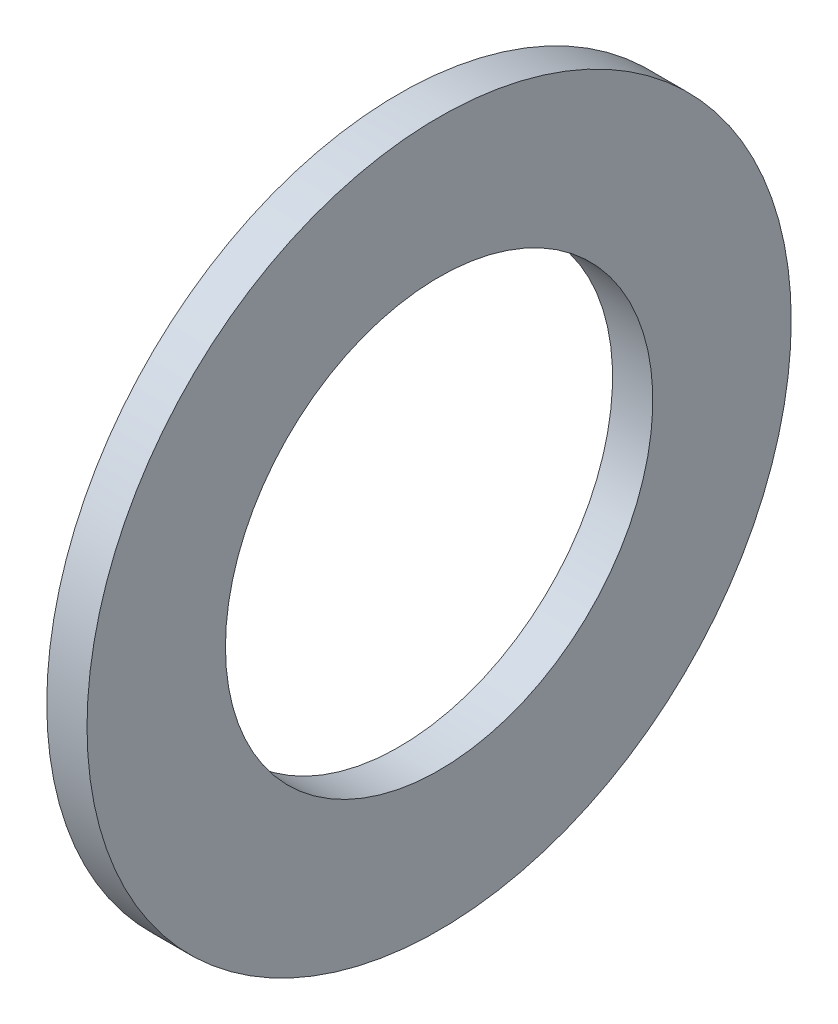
from build123d import *

# Parameters (mm, degrees)
SKETCH1_W = 2.54
SKETCH1_H = 8.7376


with BuildPart() as part:
    # Sketch1 → Base-Revolve (revolve)
    with BuildSketch(Plane.XY, mode=Mode.PRIVATE) as base_revolve_sk:
        with Locations((-1.27, 17.8562)):
            Rectangle(SKETCH1_W, SKETCH1_H)
    revolve(base_revolve_sk.sketch.rotate(Axis((-34.925, 0, 0), (1, 0, 0)), 90), axis=Axis((-34.925, 0, 0), (1, 0, 0)))


solid = part.part
